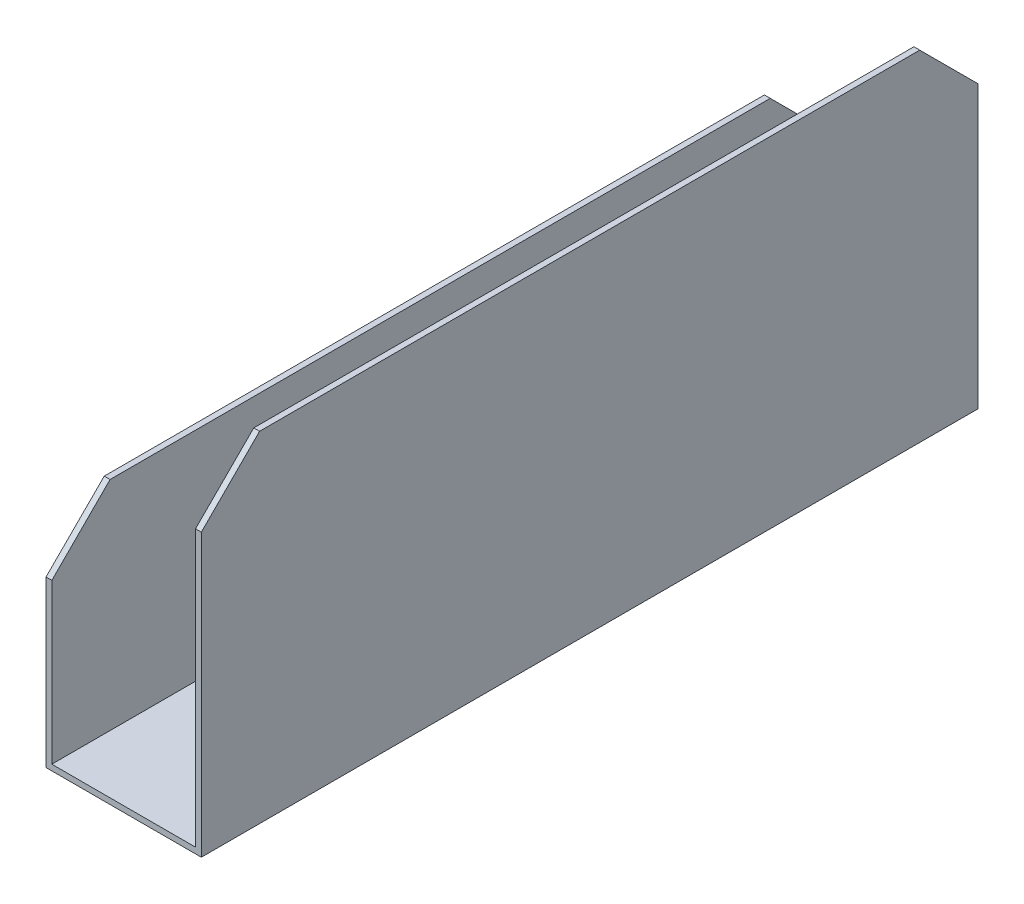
from build123d import *

# Parameters (mm, degrees)
EXTRUSION1_DEPTH = 200
CHANFREIN1_SIZE  = 15


with BuildPart() as part:
    # Esquisse1 → Extrusion1 (new body)
    with BuildSketch(Plane.XY):
        Polygon((0, 56), (0, 0), (37, 0), (37, 86), (38.5, 86), (38.5, -1.5), (-1.5, -1.5), (-1.5, 56), align=None)
    extrude(amount=EXTRUSION1_DEPTH)

    # Chanfrein1
    chanfrein1_edges = [part.edges().sort_by_distance(p)[0] for p in [
        (37.75, 86, 200),
        (-0.75, 56, 200),
        (37.75, 86, 0),
        (-0.75, 56, 0),
    ]]
    chamfer(chanfrein1_edges, length=CHANFREIN1_SIZE)


solid = part.part
